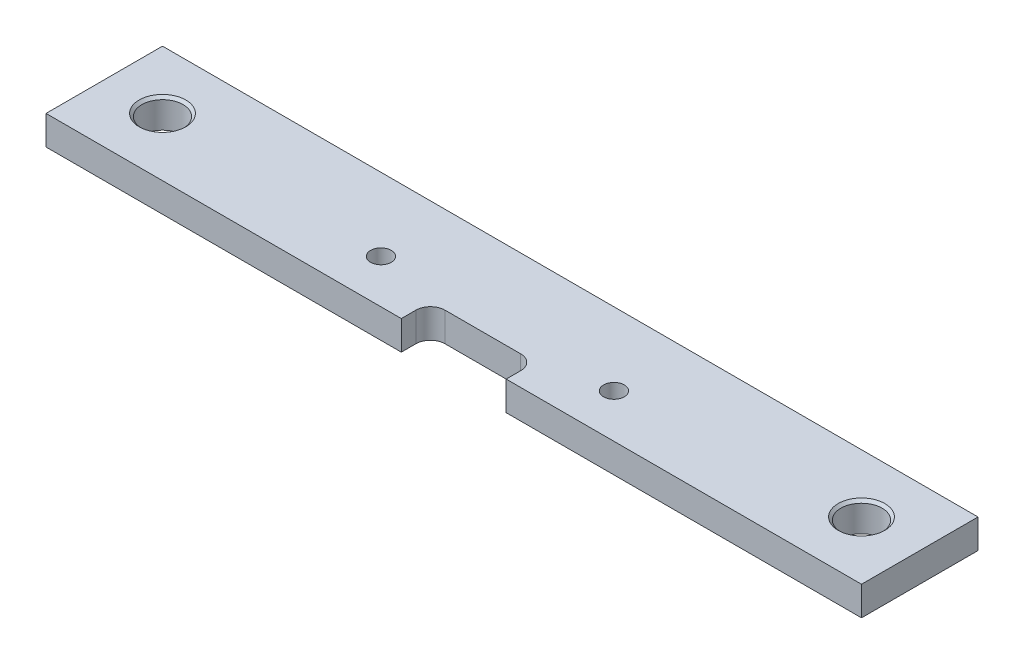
from build123d import *

# Parameters (mm, degrees)
SKETCH24_W                      = 88.9
SKETCH24_H                      = 12.7
BOSS_EXTRUDE3_DEPTH             = 3.175
F_8_CLEARANCE_HOLE1_D           = 4.4958
F_8_CLEARANCE_HOLE1_CSINK_D     = 5.08
F_8_CLEARANCE_HOLE1_CSINK_ANGLE = 90
F_4_40_TAPPED_HOLE2_D           = 2.2606
SKETCH30_W                      = 11.43
SKETCH30_H                      = 6.35
CUT_EXTRUDE6_DEPTH              = 46.01339384
FILLET2_R                       = 1.5875


with BuildPart() as part:
    # Sketch24 → Boss-Extrude3 (new body)
    with BuildSketch(Plane(origin=(0, 0, 0), x_dir=(1, 0, 0), z_dir=(0, 1, 0))):
        Rectangle(SKETCH24_W, SKETCH24_H)
    extrude(amount=BOSS_EXTRUDE3_DEPTH)

    # 8 Clearance Hole1 (through all)
    with Locations(Plane(origin=(0, 3.175, 0), x_dir=(-1, 0, 0), z_dir=(0, 1, 0))):
        with Locations((38.1, 0), (-38.1, 0)):
            CounterSinkHole(F_8_CLEARANCE_HOLE1_D / 2, F_8_CLEARANCE_HOLE1_CSINK_D / 2, counter_sink_angle=F_8_CLEARANCE_HOLE1_CSINK_ANGLE)

    # 4-40 Tapped Hole2 (through all)
    with Locations(Plane(origin=(0, 3.175, 0), x_dir=(-1, 0, 0), z_dir=(0, 1, 0))):
        with Locations((12.7, 1.5875), (-12.7, 1.5875)):
            Hole(F_4_40_TAPPED_HOLE2_D / 2)

    # Sketch30 → Cut-Extrude6 (cut, through all)
    with BuildSketch(Plane(origin=(0, 3.175, 0), x_dir=(1, 0, 0), z_dir=(0, 1, 0))):
        with Locations((0, -6.35)):
            Rectangle(SKETCH30_W, SKETCH30_H)
    extrude(amount=-CUT_EXTRUDE6_DEPTH, mode=Mode.SUBTRACT)

    # Fillet2
    fillet2_edges = [part.edges().sort_by_distance(p)[0] for p in [
        (5.715, 1.5875, 3.175),
        (-5.715, 1.5875, 3.175),
    ]]
    fillet(fillet2_edges, radius=FILLET2_R)


solid = part.part
